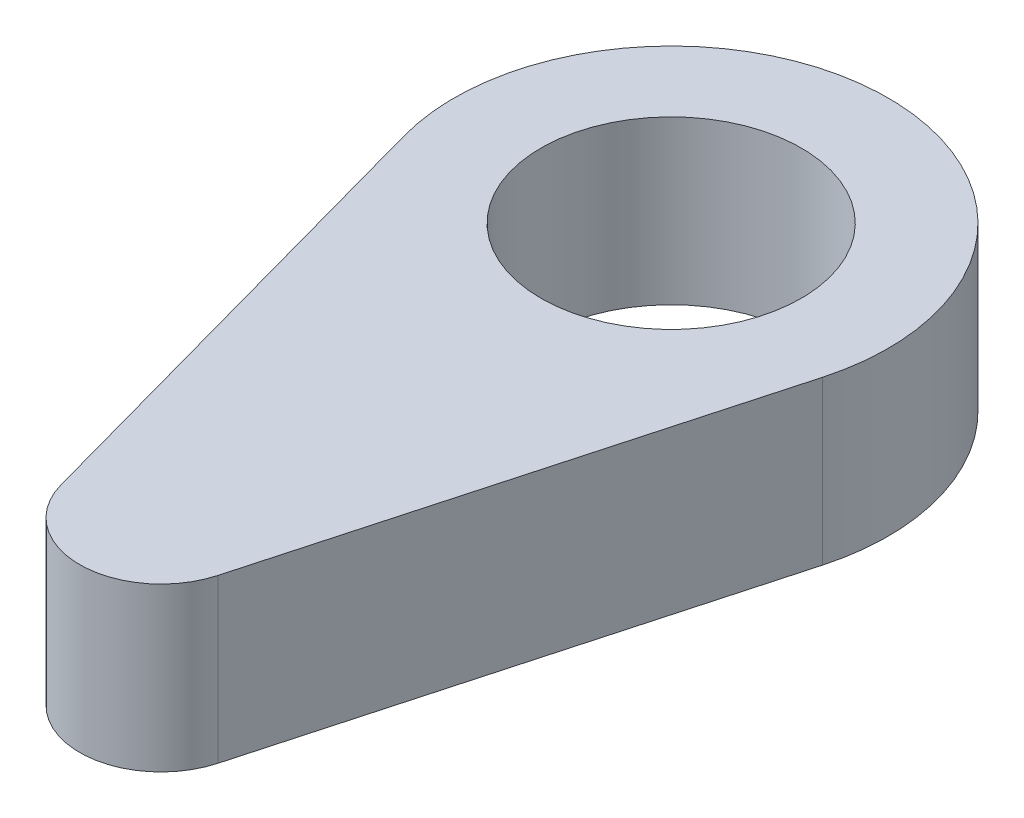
from build123d import *

# Parameters (mm, degrees)
SKETCH1_R           = 2.4003
BOSS_EXTRUDE1_DEPTH = 3


with BuildPart() as part:
    # Sketch1 → Boss-Extrude1 (new body)
    with BuildSketch(Plane(origin=(0, 0, 0), x_dir=(1, 0, 0), z_dir=(0, 1, 0))):
        with BuildLine():
            Line((-3.856064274, -1.063375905), (-1.446024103, -9.802778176))
            ThreePointArc((-1.446024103, -9.802778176), (0, -10.904012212), (1.446024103, -9.802778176))
            Line((1.446024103, -9.802778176), (3.856064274, -1.063375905))
            ThreePointArc((3.856064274, -1.063375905), (0, 4), (-3.856064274, -1.063375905))
        make_face()
        with Locations(Location((0, 0, 0), (0, 0, 270))):
            Circle(SKETCH1_R, mode=Mode.SUBTRACT)
    extrude(amount=BOSS_EXTRUDE1_DEPTH)


solid = part.part
